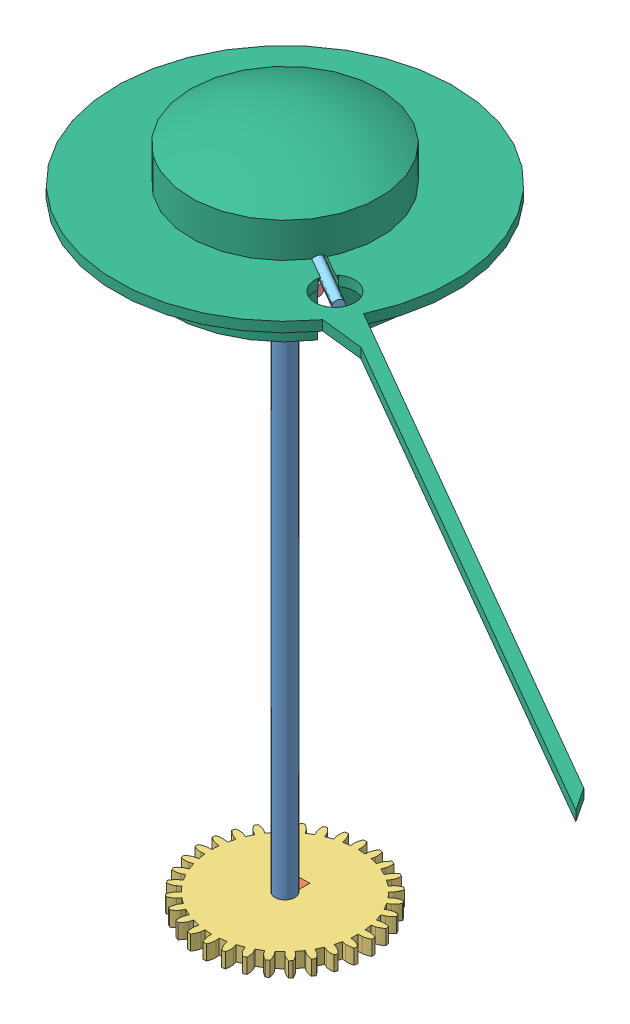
SolidWorks assembly Axle Assembly B Layer 1.SLDASM, configuration Default (file format 6000). Lengths in mm.
Overall size (101 69.25 77.94).
6 component instances, 6 part files, 15 mates.
Components (placement in the parent):
- Axle B Layer 1-1: Axle B Layer 1.SLDPRT [Default] at (-101.605 -11.101 55.0621) size (2 64.5 2)
- Key-1: Key.SLDPRT [Default] at (-101.605 -11.101 55.0621) x (0 0 1) z (-1 0 0) size (2 1.5 1)
- Gear 32T Axle E Gear 1-2: Gear 32T Axle E Gear 1.sldprt [Default] at (-101.605 -11.101 56.0621) size (16.99 1.5 16.99)
- Rod Lunar-1: Rod Lunar.SLDPRT [Default] at (-101.605 48.399 56.0621) x (0.866025 0 0.5) z (0.5 0 -0.866025) size (9.21 3.75 3)
- Pointer Moon-1: Pointer Moon.SLDPRT [Default] at (-101.605 51.149 56.0621) x (0.866025 0 0.5) z (-0.5 0 0.866025) size (16.05 1 2.5)
- Plate Cap-1: Plate Cap.SLDPRT [Default] at (-101.605 51.149 56.0621) x (0.866025 0 0.5) z (-0.5 0 0.866025) size (97 11.5 34)
Mates (geometry in assembly coordinates):
- Coincident1: coincident anti-aligned: plane of Axle B Layer 1-1 through (-101.605 -11.101 56.0621) normal (0 0 -1); plane of Key-1 through (-102.105 -9.601 56.0621) normal (0 0 1)
- Coincident2: coincident anti-aligned: plane of Axle B Layer 1-1 through (-102.105 -9.601 56.0621) normal (0 -1 0); plane of Key-1 through (-101.605 -9.601 55.0621) normal (0 1 0)
- Coincident3: coincident anti-aligned: plane of Axle B Layer 1-1 through (-101.105 -11.101 56.0621) normal (-1 0 0); plane of Key-1 through (-101.105 -9.601 54.0621) normal (1 0 0)
- Coincident4: coincident aligned: plane of Key-1 through (-101.605 -11.101 55.0621) normal (0 -1 0); plane of Gear 32T Axle E Gear 1-2 through (-111.9781 -11.101 58.316) normal (0 -1 0)
- Concentric1: concentric aligned: cylinder of Axle B Layer 1-1 through (-101.605 53.399 56.0621) axis (0 -1 0) radius 1; cylinder of Gear 32T Axle E Gear 1-2 through (-101.605 -9.601 56.0621) axis (0 -1 0) radius 1
- Coincident5: coincident aligned: line of Key-1 through (-101.105 -11.101 54.0621) axis (-1 0 0); line of Gear 32T Axle E Gear 1-2 through (-101.105 -11.101 54.0621) axis (-1 0 0)
- Coincident9: coincident anti-aligned: plane of Axle B Layer 1-1 through (-101.605 47.399 55.0621) normal (0 1 0); plane of Rod Lunar-1 through (-101.605 47.399 56.0621) normal (0 -1 0)
- Coincident10: coincident anti-aligned: plane of Axle B Layer 1-1 through (-101.605 47.399 55.0621) normal (-0.5 0 -0.866025); plane of Rod Lunar-1 through (-102.038 47.399 55.3121) normal (0.5 0 0.866025)
- Coincident11: coincident anti-aligned: plane of Axle B Layer 1-1 through (-100.739 47.399 55.0621) normal (1 0 0); plane of Rod Lunar-1 through (-100.739 47.399 56.0621) normal (-1 0 0)
- Coincident12: coincident anti-aligned: plane of Rod Lunar-1 through (-101.605 51.149 56.0621) normal (0 1 0); plane of Pointer Moon-1 through (-101.605 51.149 56.0621) normal (0 -1 0)
- Coincident13: coincident anti-aligned: plane of Axle B Layer 1-1 through (-102.4711 47.399 56.5621) normal (-0.5 0 0.866025); plane of Pointer Moon-1 through (-102.4711 52.149 56.5621) normal (0.5 0 -0.866025)
- Coincident14: coincident anti-aligned: plane of Axle B Layer 1-1 through (-100.739 47.399 56.5621) normal (0.5 0 0.866025); plane of Pointer Moon-1 through (-101.605 52.149 57.0621) normal (-0.5 0 -0.866025)
- Coincident15: coincident anti-aligned: plane of Pointer Moon-1 through (-101.605 52.149 56.0621) normal (0 1 0); plane of Plate Cap-1 through (-101.605 52.149 56.0621) normal (0 -1 0)
- Coincident16: coincident anti-aligned: plane of Axle B Layer 1-1 through (-100.739 47.399 56.5621) normal (0.5 0 0.866025); plane of Plate Cap-1 through (-100.739 52.149 56.5621) normal (-0.5 0 -0.866025)
- Coincident17: coincident anti-aligned: plane of Axle B Layer 1-1 through (-100.739 47.399 55.0621) normal (1 0 0); plane of Plate Cap-1 through (-100.739 52.149 55.5621) normal (-1 0 0)
